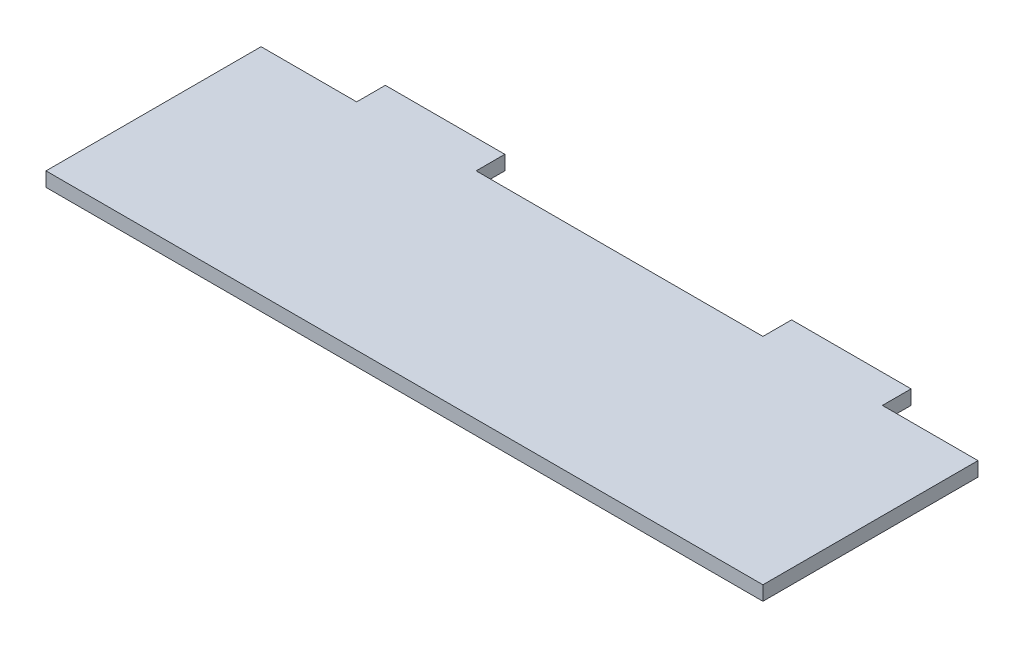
from build123d import *

# Parameters (mm, degrees)
BOSS_EXTRUDE1_DEPTH = 3


with BuildPart() as part:
    # Sketch1 → Boss-Extrude1 (new body)
    with BuildSketch(Plane(origin=(0, 0, 0), x_dir=(1, 0, 0), z_dir=(0, 1, 0))):
        Polygon((-75, 22.5), (-55, 22.5), (-55, 28.5), (-30, 28.5), (-30, 22.5), (30, 22.5), (30, 28.5), (55, 28.5), (55, 22.5), (75, 22.5), (75, -22.5), (-75, -22.5), align=None)
    extrude(amount=BOSS_EXTRUDE1_DEPTH)


solid = part.part
